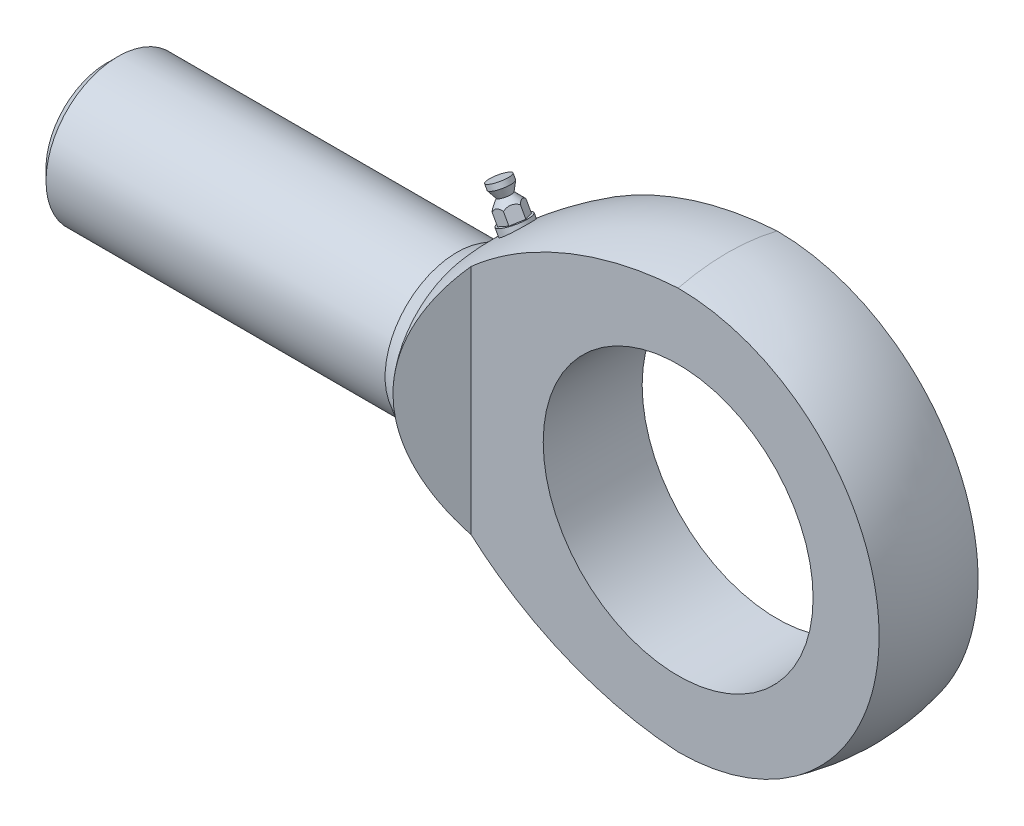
ISO-10303-21;
HEADER;
FILE_DESCRIPTION(('STEP AP214'),'2;1');
FILE_NAME('part.step','',(''),(''),'','','');
FILE_SCHEMA(('AUTOMOTIVE_DESIGN { 1 0 10303 214 1 1 1 1 }'));
ENDSEC;
DATA;
#1=APPLICATION_CONTEXT('core data for automotive mechanical design processes');
#2=APPLICATION_PROTOCOL_DEFINITION('international standard','automotive_design',2000,#1);
#3=PRODUCT_CONTEXT('',#1,'mechanical');
#4=PRODUCT('Part','Part','',(#3));
#5=PRODUCT_RELATED_PRODUCT_CATEGORY('part','',(#4));
#6=PRODUCT_DEFINITION_FORMATION('','',#4);
#7=PRODUCT_DEFINITION_CONTEXT('part definition',#1,'design');
#8=PRODUCT_DEFINITION('design','',#6,#7);
#9=PRODUCT_DEFINITION_SHAPE('','',#8);
#10=(LENGTH_UNIT() NAMED_UNIT(*) SI_UNIT(.MILLI.,.METRE.));
#11=(NAMED_UNIT(*) PLANE_ANGLE_UNIT() SI_UNIT($,.RADIAN.));
#12=(NAMED_UNIT(*) SI_UNIT($,.STERADIAN.) SOLID_ANGLE_UNIT());
#13=UNCERTAINTY_MEASURE_WITH_UNIT(LENGTH_MEASURE(1.E-05),#10,'distance_accuracy_value','');
#14=(GEOMETRIC_REPRESENTATION_CONTEXT(3) GLOBAL_UNCERTAINTY_ASSIGNED_CONTEXT((#13)) GLOBAL_UNIT_ASSIGNED_CONTEXT((#10,
#11,#12)) REPRESENTATION_CONTEXT('',''));
#15=CARTESIAN_POINT('',(0.,0.,0.));
#16=DIRECTION('',(0.,0.,1.));
#17=DIRECTION('',(1.,0.,0.));
#18=AXIS2_PLACEMENT_3D('',#15,#16,#17);
#19=CARTESIAN_POINT('',(43.5603030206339,17.4393707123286,0.6));
#20=DIRECTION('',(-0.485648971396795,0.874153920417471,0.));
#21=DIRECTION('',(-0.874153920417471,-0.485648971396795,0.));
#22=AXIS2_PLACEMENT_3D('',#19,#20,#21);
#23=PLANE('',#22);
#24=CARTESIAN_POINT('',(43.5603030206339,17.4393707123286,0.));
#25=DIRECTION('',(-0.485648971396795,0.874153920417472,0.));
#26=DIRECTION('',(-0.874153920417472,-0.485648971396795,0.));
#27=AXIS2_PLACEMENT_3D('',#24,#25,#26);
#28=CIRCLE('',#27,1.2);
#29=CARTESIAN_POINT('',(42.511318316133,16.8565919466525,0.));
#30=VERTEX_POINT('',#29);
#31=EDGE_CURVE('E113',#30,#30,#28,.F.);
#32=ORIENTED_EDGE('',*,*,#31,.F.);
#33=EDGE_LOOP('',(#32));
#34=FACE_BOUND('',#33,.T.);
#35=ADVANCED_FACE('F16',(#34),#23,.T.);
#36=CARTESIAN_POINT('',(43.705997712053,17.1771245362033,0.));
#37=DIRECTION('',(-0.485648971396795,0.874153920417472,0.));
#38=DIRECTION('',(-0.874153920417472,-0.485648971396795,0.));
#39=AXIS2_PLACEMENT_3D('',#36,#37,#38);
#40=CYLINDRICAL_SURFACE('',#39,1.2);
#41=ORIENTED_EDGE('',*,*,#31,.T.);
#42=EDGE_LOOP('',(#41));
#43=FACE_BOUND('',#42,.T.);
#44=CARTESIAN_POINT('',(43.8516924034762,16.9148783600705,0.));
#45=DIRECTION('',(-0.485648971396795,0.874153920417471,0.));
#46=DIRECTION('',(-0.874153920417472,-0.485648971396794,0.));
#47=AXIS2_PLACEMENT_3D('',#44,#45,#46);
#48=CIRCLE('',#47,1.19999999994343);
#49=CARTESIAN_POINT('',(42.8027076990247,16.3320995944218,0.));
#50=VERTEX_POINT('',#49);
#51=EDGE_CURVE('E347',#50,#50,#48,.F.);
#52=ORIENTED_EDGE('',*,*,#51,.F.);
#53=EDGE_LOOP('',(#52));
#54=FACE_BOUND('',#53,.T.);
#55=ADVANCED_FACE('F561',(#43,#54),#40,.T.);
#56=CARTESIAN_POINT('',(43.8516924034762,16.9148783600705,0.));
#57=DIRECTION('',(-0.485648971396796,0.874153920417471,0.));
#58=DIRECTION('',(-0.874153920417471,-0.485648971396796,0.));
#59=AXIS2_PLACEMENT_3D('',#56,#57,#58);
#60=CONICAL_SURFACE('',#59,1.19999999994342,0.485500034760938);
#61=ORIENTED_EDGE('',*,*,#51,.T.);
#62=EDGE_LOOP('',(#61));
#63=FACE_BOUND('',#62,.T.);
#64=CARTESIAN_POINT('',(44.2644940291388,16.1718475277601,0.));
#65=DIRECTION('',(0.485648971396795,-0.874153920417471,0.));
#66=DIRECTION('',(0.87415392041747,0.485648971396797,0.));
#67=AXIS2_PLACEMENT_3D('',#64,#65,#66);
#68=CIRCLE('',#67,0.751521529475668);
#69=CARTESIAN_POINT('',(44.9214395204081,16.5368231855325,0.));
#70=VERTEX_POINT('',#69);
#71=EDGE_CURVE('E198',#70,#70,#68,.T.);
#72=ORIENTED_EDGE('',*,*,#71,.F.);
#73=EDGE_LOOP('',(#72));
#74=FACE_BOUND('',#73,.T.);
#75=ADVANCED_FACE('F130',(#63,#74),#60,.T.);
#76=CARTESIAN_POINT('',(44.697132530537,15.3931109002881,0.));
#77=DIRECTION('',(0.485648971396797,-0.874153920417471,0.));
#78=DIRECTION('',(0.874153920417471,0.485648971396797,0.));
#79=AXIS2_PLACEMENT_3D('',#76,#77,#78);
#80=CONICAL_SURFACE('',#79,1.44752679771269,0.663225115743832);
#81=CARTESIAN_POINT('',(44.0636859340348,15.047268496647,-1.24999999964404));
#82=CARTESIAN_POINT('',(44.004073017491,15.0725079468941,-1.18097197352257));
#83=CARTESIAN_POINT('',(43.9442975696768,15.0936244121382,-1.10822973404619));
#84=CARTESIAN_POINT('',(43.828943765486,15.1201956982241,-0.955925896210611));
#85=CARTESIAN_POINT('',(43.7734125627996,15.1254941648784,-0.876304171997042));
#86=CARTESIAN_POINT('',(43.6921668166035,15.1148088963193,-0.744303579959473));
#87=CARTESIAN_POINT('',(43.6632786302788,15.1063301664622,-0.693432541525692));
#88=CARTESIAN_POINT('',(43.6108431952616,15.0799686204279,-0.591866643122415));
#89=CARTESIAN_POINT('',(43.5872593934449,15.0621531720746,-0.54117310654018));
#90=CARTESIAN_POINT('',(43.5457003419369,15.0183979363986,-0.441443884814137));
#91=CARTESIAN_POINT('',(43.5276975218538,14.9924993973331,-0.392401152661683));
#92=CARTESIAN_POINT('',(43.4964763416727,14.9343860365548,-0.296246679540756));
#93=CARTESIAN_POINT('',(43.4832884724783,14.9021328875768,-0.24914886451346));
#94=CARTESIAN_POINT('',(43.4634436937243,14.8412258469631,-0.167869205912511));
#95=CARTESIAN_POINT('',(43.4559824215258,14.8134474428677,-0.133205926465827));
#96=CARTESIAN_POINT('',(43.4430550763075,14.756247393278,-0.0655180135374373));
#97=CARTESIAN_POINT('',(43.4375683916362,14.7268466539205,-0.0324797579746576));
#98=CARTESIAN_POINT('',(43.432819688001,14.6967816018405,-6.49388758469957E-08));
#99=B_SPLINE_CURVE_WITH_KNOTS('',3,(#81,#82,#83,#84,#85,#86,#87,#88,#89,#90,#91,#92,#93,#94,#95,
#96,#97,#98),.UNSPECIFIED.,.F.,.F.,(4,2,2,2,2,2,2,2,4),(0.,0.286581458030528,0.575986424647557,
0.752340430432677,0.927439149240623,1.10165855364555,1.27696282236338,1.41199199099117,
1.54556771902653),.UNSPECIFIED.);
#100=CARTESIAN_POINT('',(44.0636859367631,15.0472685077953,-1.25000000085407));
#101=VERTEX_POINT('',#100);
#102=CARTESIAN_POINT('',(43.4328197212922,14.6967818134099,-2.66556516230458E-08));
#103=VERTEX_POINT('',#102);
#104=EDGE_CURVE('E87',#101,#103,#99,.T.);
#105=ORIENTED_EDGE('',*,*,#104,.T.);
#106=CARTESIAN_POINT('',(43.4328197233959,14.6967816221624,7.20144435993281E-08));
#107=CARTESIAN_POINT('',(43.4428827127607,14.7607305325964,0.0690280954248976));
#108=CARTESIAN_POINT('',(43.4565322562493,14.8226393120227,0.141770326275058));
#109=CARTESIAN_POINT('',(43.4949118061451,14.9346193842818,0.294074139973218));
#110=CARTESIAN_POINT('',(43.5197496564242,14.9845680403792,0.373695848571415));
#111=CARTESIAN_POINT('',(43.5717434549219,15.0479059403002,0.505696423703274));
#112=CARTESIAN_POINT('',(43.5942037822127,15.0679546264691,0.556567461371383));
#113=CARTESIAN_POINT('',(43.6442875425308,15.0985491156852,0.658133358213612));
#114=CARTESIAN_POINT('',(43.6718730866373,15.1091615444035,0.708826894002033));
#115=CARTESIAN_POINT('',(43.7309793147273,15.1213323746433,0.808556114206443));
#116=CARTESIAN_POINT('',(43.7624795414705,15.1229359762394,0.857598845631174));
#117=CARTESIAN_POINT('',(43.828315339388,15.1187440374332,0.953753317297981));
#118=CARTESIAN_POINT('',(43.8626673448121,15.1129023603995,1.00085113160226));
#119=CARTESIAN_POINT('',(43.9248651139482,15.0975752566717,1.08213078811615));
#120=CARTESIAN_POINT('',(43.9523924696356,15.0892352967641,1.11679406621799));
#121=CARTESIAN_POINT('',(44.0077883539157,15.0699932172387,1.18448197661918));
#122=CARTESIAN_POINT('',(44.0356500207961,15.0591196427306,1.21752023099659));
#123=CARTESIAN_POINT('',(44.0636858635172,15.0472685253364,1.24999992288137));
#124=B_SPLINE_CURVE_WITH_KNOTS('',3,(#106,#107,#108,#109,#110,#111,#112,#113,#114,#115,#116,
#117,#118,#119,#120,#121,#122,#123),.UNSPECIFIED.,.F.,.F.,(4,2,2,2,2,2,2,2,4),(0.,
0.286581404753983,0.575986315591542,0.752340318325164,0.927439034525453,1.10165843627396,
1.27696270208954,1.41199186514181,1.54556758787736),.UNSPECIFIED.);
#125=CARTESIAN_POINT('',(44.0636858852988,15.0472685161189,1.2499999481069));
#126=VERTEX_POINT('',#125);
#127=EDGE_CURVE('E21',#103,#126,#124,.T.);
#128=ORIENTED_EDGE('',*,*,#127,.T.);
#129=CARTESIAN_POINT('',(44.0636859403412,15.0472684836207,1.24999996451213));
#130=CARTESIAN_POINT('',(44.1085869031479,15.1305721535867,1.24999998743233));
#131=CARTESIAN_POINT('',(44.1589489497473,15.2128771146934,1.24999999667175));
#132=CARTESIAN_POINT('',(44.2741951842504,15.3675616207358,1.25000000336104));
#133=CARTESIAN_POINT('',(44.33921756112,15.4398353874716,1.25000000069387));
#134=CARTESIAN_POINT('',(44.4578311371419,15.5401848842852,1.24999999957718));
#135=CARTESIAN_POINT('',(44.505965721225,15.5744972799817,1.2499999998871));
#136=CARTESIAN_POINT('',(44.6073090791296,15.6335697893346,1.2500000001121));
#137=CARTESIAN_POINT('',(44.6604792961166,15.6583961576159,1.25000000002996));
#138=CARTESIAN_POINT('',(44.7699181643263,15.6985300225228,1.24999999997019));
#139=CARTESIAN_POINT('',(44.8261699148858,15.7138846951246,1.24999999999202));
#140=CARTESIAN_POINT('',(44.9405342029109,15.7366534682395,1.25000000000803));
#141=CARTESIAN_POINT('',(44.9986561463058,15.744017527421,1.25000000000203));
#142=CARTESIAN_POINT('',(45.1018751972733,15.7514803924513,1.24999999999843));
#143=CARTESIAN_POINT('',(45.1468968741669,15.752859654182,1.24999999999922));
#144=CARTESIAN_POINT('',(45.2364543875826,15.752596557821,1.25000000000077));
#145=CARTESIAN_POINT('',(45.28099023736,15.7509865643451,1.25000000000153));
#146=CARTESIAN_POINT('',(45.3254183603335,15.7482424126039,1.25));
#147=B_SPLINE_CURVE_WITH_KNOTS('',3,(#129,#130,#131,#132,#133,#134,#135,#136,#137,#138,#139,
#140,#141,#142,#143,#144,#145,#146),.UNSPECIFIED.,.F.,.F.,(4,2,2,2,2,2,2,2,4),(0.,
0.286581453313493,0.575986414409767,0.752340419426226,0.927439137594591,1.10165854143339,
1.27696280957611,1.41199199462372,1.54556773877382),.UNSPECIFIED.);
#148=CARTESIAN_POINT('',(45.3254183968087,15.7482424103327,1.25));
#149=VERTEX_POINT('',#148);
#150=EDGE_CURVE('E94',#126,#149,#147,.T.);
#151=ORIENTED_EDGE('',*,*,#150,.T.);
#152=CARTESIAN_POINT('',(45.3254184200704,15.7482423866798,1.24999998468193));
#153=CARTESIAN_POINT('',(45.3354814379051,15.81219132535,1.18097196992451));
#154=CARTESIAN_POINT('',(45.3491309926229,15.8741001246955,1.10822973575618));
#155=CARTESIAN_POINT('',(45.3875105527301,15.9860802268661,0.955925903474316));
#156=CARTESIAN_POINT('',(45.4123484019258,16.0360288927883,0.876304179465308));
#157=CARTESIAN_POINT('',(45.4643422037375,16.0993668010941,0.744303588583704));
#158=CARTESIAN_POINT('',(45.4868025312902,16.1194154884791,0.69343255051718));
#159=CARTESIAN_POINT('',(45.5368862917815,16.150009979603,0.591866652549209));
#160=CARTESIAN_POINT('',(45.5644718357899,16.1606224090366,0.541173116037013));
#161=CARTESIAN_POINT('',(45.6235780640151,16.1727932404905,0.441443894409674));
#162=CARTESIAN_POINT('',(45.6550782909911,16.174396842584,0.392401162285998));
#163=CARTESIAN_POINT('',(45.7209140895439,16.1702049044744,0.296246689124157));
#164=CARTESIAN_POINT('',(45.7552660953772,16.1643632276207,0.249148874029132));
#165=CARTESIAN_POINT('',(45.8174638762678,16.1490361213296,0.167869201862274));
#166=CARTESIAN_POINT('',(45.8449912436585,16.1406961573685,0.133205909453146));
#167=CARTESIAN_POINT('',(45.9003871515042,16.1214540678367,0.0655179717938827));
#168=CARTESIAN_POINT('',(45.9282488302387,16.110580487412,0.0324797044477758));
#169=CARTESIAN_POINT('',(45.9562846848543,16.0987293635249,1.02537500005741E-11));
#170=B_SPLINE_CURVE_WITH_KNOTS('',3,(#152,#153,#154,#155,#156,#157,#158,#159,#160,#161,#162,
#163,#164,#165,#166,#167,#168,#169),.UNSPECIFIED.,.F.,.F.,(4,2,2,2,2,2,2,2,4),(0.,
0.286581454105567,0.575986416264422,0.752340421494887,0.927439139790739,1.10165854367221,
1.27696281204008,1.41199203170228,1.54556780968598),.UNSPECIFIED.);
#171=CARTESIAN_POINT('',(45.9562846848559,16.0987293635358,1.90440255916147E-12));
#172=VERTEX_POINT('',#171);
#173=EDGE_CURVE('E112',#149,#172,#170,.T.);
#174=ORIENTED_EDGE('',*,*,#173,.T.);
#175=CARTESIAN_POINT('',(45.9562846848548,16.0987293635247,-9.83171928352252E-12));
#176=CARTESIAN_POINT('',(45.8966717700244,16.1239688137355,-0.0690280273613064));
#177=CARTESIAN_POINT('',(45.8368963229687,16.1450852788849,-0.141770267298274));
#178=CARTESIAN_POINT('',(45.7215425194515,16.1716565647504,-0.294074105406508));
#179=CARTESIAN_POINT('',(45.6660113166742,16.1769550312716,-0.373695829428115));
#180=CARTESIAN_POINT('',(45.5847655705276,16.1662697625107,-0.505696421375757));
#181=CARTESIAN_POINT('',(45.5558773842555,16.1577910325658,-0.556567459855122));
#182=CARTESIAN_POINT('',(45.5034419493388,16.1314294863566,-0.658133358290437));
#183=CARTESIAN_POINT('',(45.4798581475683,16.1136140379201,-0.708826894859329));
#184=CARTESIAN_POINT('',(45.4382990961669,16.0698588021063,-0.808556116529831));
#185=CARTESIAN_POINT('',(45.4202962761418,16.04396026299,-0.857598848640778));
#186=CARTESIAN_POINT('',(45.389075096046,15.9858469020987,-0.95375332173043));
#187=CARTESIAN_POINT('',(45.3758872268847,15.953593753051,-1.0008511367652));
#188=CARTESIAN_POINT('',(45.3560424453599,15.892686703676,-1.08213080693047));
#189=CARTESIAN_POINT('',(45.3485811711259,15.8649082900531,-1.1167940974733));
#190=CARTESIAN_POINT('',(45.335653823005,15.8077082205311,-1.18448203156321));
#191=CARTESIAN_POINT('',(45.3301671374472,15.7783074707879,-1.21752029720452));
#192=CARTESIAN_POINT('',(45.3254184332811,15.7482424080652,-1.24999999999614));
#193=B_SPLINE_CURVE_WITH_KNOTS('',3,(#175,#176,#177,#178,#179,#180,#181,#182,#183,#184,#185,
#186,#187,#188,#189,#190,#191,#192),.UNSPECIFIED.,.F.,.F.,(4,2,2,2,2,2,2,2,4),(0.,
0.286581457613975,0.575986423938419,0.752340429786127,0.927439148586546,1.10165855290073,
1.27696282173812,1.41199203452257,1.54556780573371),.UNSPECIFIED.);
#194=CARTESIAN_POINT('',(45.3254184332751,15.7482424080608,-1.25000000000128));
#195=VERTEX_POINT('',#194);
#196=EDGE_CURVE('E136',#172,#195,#193,.T.);
#197=ORIENTED_EDGE('',*,*,#196,.T.);
#198=CARTESIAN_POINT('',(45.32541843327,15.7482424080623,-1.25));
#199=CARTESIAN_POINT('',(45.2309675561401,15.7541271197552,-1.25));
#200=CARTESIAN_POINT('',(45.1344796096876,15.7548474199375,-1.25));
#201=CARTESIAN_POINT('',(44.9422591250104,15.7387142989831,-1.25));
#202=CARTESIAN_POINT('',(44.846543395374,15.7216876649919,-1.25));
#203=CARTESIAN_POINT('',(44.6986778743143,15.6739908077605,-1.25));
#204=CARTESIAN_POINT('',(44.6441154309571,15.6512483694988,-1.25));
#205=CARTESIAN_POINT('',(44.5404203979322,15.5964088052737,-1.25));
#206=CARTESIAN_POINT('',(44.4912519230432,15.564379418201,-1.25));
#207=CARTESIAN_POINT('',(44.3993602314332,15.4926611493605,-1.25));
#208=CARTESIAN_POINT('',(44.3566058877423,15.4530115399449,-1.25));
#209=CARTESIAN_POINT('',(44.2768562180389,15.36793746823,-1.25));
#210=CARTESIAN_POINT('',(44.2398984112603,15.3224785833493,-1.25));
#211=CARTESIAN_POINT('',(44.1790323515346,15.2387815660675,-1.25));
#212=CARTESIAN_POINT('',(44.154076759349,15.201283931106,-1.25));
#213=CARTESIAN_POINT('',(44.1069877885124,15.125104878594,-1.25));
#214=CARTESIAN_POINT('',(44.0848269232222,15.0864405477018,-1.25));
#215=CARTESIAN_POINT('',(44.0636859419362,15.0472685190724,-1.25));
#216=B_SPLINE_CURVE_WITH_KNOTS('',3,(#198,#199,#200,#201,#202,#203,#204,#205,#206,#207,#208,
#209,#210,#211,#212,#213,#214,#215),.UNSPECIFIED.,.F.,.F.,(4,2,2,2,2,2,2,2,4),(0.,
0.286581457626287,0.575986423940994,0.752340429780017,0.92743914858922,1.10165855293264,
1.27696282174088,1.41199202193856,1.5455677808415),.UNSPECIFIED.);
#217=EDGE_CURVE('E352',#195,#101,#216,.T.);
#218=ORIENTED_EDGE('',*,*,#217,.T.);
#219=EDGE_LOOP('',(#105,#128,#151,#174,#197,#218));
#220=FACE_BOUND('',#219,.T.);
#221=ORIENTED_EDGE('',*,*,#71,.T.);
#222=EDGE_LOOP('',(#221));
#223=FACE_BOUND('',#222,.T.);
#224=ADVANCED_FACE('F91',(#220,#223),#80,.T.);
#225=CARTESIAN_POINT('',(-7.105427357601E-12,0.,0.));
#226=DIRECTION('',(1.,0.,0.));
#227=DIRECTION('',(0.,0.,-1.));
#228=AXIS2_PLACEMENT_3D('',#225,#226,#227);
#229=CONICAL_SURFACE('',#228,6.77132999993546,1.448623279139);
#230=CARTESIAN_POINT('',(-0.831414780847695,0.,0.));
#231=VERTEX_POINT('',#230);
#232=VERTEX_LOOP('',#231);
#233=FACE_BOUND('',#232,.T.);
#234=CARTESIAN_POINT('',(-3.85282084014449E-12,0.,0.));
#235=DIRECTION('',(1.,0.,0.));
#236=DIRECTION('',(0.,0.,-1.));
#237=AXIS2_PLACEMENT_3D('',#234,#235,#236);
#238=CIRCLE('',#237,6.77132999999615);
#239=CARTESIAN_POINT('',(-3.85260399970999E-12,0.,-6.77132999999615));
#240=VERTEX_POINT('',#239);
#241=EDGE_CURVE('E298',#240,#240,#238,.T.);
#242=ORIENTED_EDGE('',*,*,#241,.F.);
#243=EDGE_LOOP('',(#242));
#244=FACE_BOUND('',#243,.T.);
#245=ADVANCED_FACE('F129',(#233,#244),#229,.T.);
#246=CARTESIAN_POINT('',(42.9294367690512,17.0888837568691,-1.25));
#247=DIRECTION('',(0.,0.,1.));
#248=DIRECTION('',(1.,0.,0.));
#249=AXIS2_PLACEMENT_3D('',#246,#247,#248);
#250=PLANE('',#249);
#251=DIRECTION('',(-0.874153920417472,-0.485648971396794,0.));
#252=VECTOR('',#251,1.);
#253=CARTESIAN_POINT('',(45.3086393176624,14.2924165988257,-1.25));
#254=LINE('',#253,#252);
#255=CARTESIAN_POINT('',(44.6777730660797,13.9419296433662,-1.25000000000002));
#256=VERTEX_POINT('',#255);
#257=CARTESIAN_POINT('',(45.9395055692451,14.6429035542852,-1.25000000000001));
#258=VERTEX_POINT('',#257);
#259=EDGE_CURVE('E321',#256,#258,#254,.F.);
#260=ORIENTED_EDGE('',*,*,#259,.F.);
#261=DIRECTION('',(-0.485648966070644,0.874153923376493,-1.05532450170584E-08));
#262=VECTOR('',#261,1.);
#263=CARTESIAN_POINT('',(44.6777730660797,13.9419296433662,-1.25000000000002));
#264=LINE('',#263,#262);
#265=EDGE_CURVE('E295',#256,#101,#264,.T.);
#266=ORIENTED_EDGE('',*,*,#265,.T.);
#267=ORIENTED_EDGE('',*,*,#217,.F.);
#268=DIRECTION('',(0.485648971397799,-0.874153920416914,1.9995455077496E-12));
#269=VECTOR('',#268,1.);
#270=CARTESIAN_POINT('',(45.3254184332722,15.7482424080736,-1.25000000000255));
#271=LINE('',#270,#269);
#272=EDGE_CURVE('E312',#195,#258,#271,.T.);
#273=ORIENTED_EDGE('',*,*,#272,.T.);
#274=EDGE_LOOP('',(#260,#266,#267,#273));
#275=FACE_BOUND('',#274,.T.);
#276=ADVANCED_FACE('F359',(#275),#250,.F.);
#277=CARTESIAN_POINT('',(44.1911692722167,17.7898576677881,-1.25));
#278=DIRECTION('',(-0.757039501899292,-0.420584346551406,0.499999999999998));
#279=DIRECTION('',(0.551113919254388,0.,0.834430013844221));
#280=AXIS2_PLACEMENT_3D('',#277,#278,#279);
#281=PLANE('',#280);
#282=DIRECTION('',(0.43707696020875,0.242824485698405,0.866025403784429));
#283=VECTOR('',#282,1.);
#284=CARTESIAN_POINT('',(45.9395055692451,14.6429035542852,-1.25000000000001));
#285=LINE('',#284,#283);
#286=CARTESIAN_POINT('',(46.5703718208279,14.9933905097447,0.));
#287=VERTEX_POINT('',#286);
#288=EDGE_CURVE('E328',#258,#287,#285,.T.);
#289=ORIENTED_EDGE('',*,*,#288,.F.);
#290=ORIENTED_EDGE('',*,*,#272,.F.);
#291=ORIENTED_EDGE('',*,*,#196,.F.);
#292=DIRECTION('',(0.485648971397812,-0.874153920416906,-2.01909509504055E-12));
#293=VECTOR('',#292,1.);
#294=CARTESIAN_POINT('',(45.9562846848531,16.0987293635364,2.53920148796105E-12));
#295=LINE('',#294,#293);
#296=EDGE_CURVE('E307',#172,#287,#295,.T.);
#297=ORIENTED_EDGE('',*,*,#296,.T.);
#298=EDGE_LOOP('',(#289,#290,#291,#297));
#299=FACE_BOUND('',#298,.T.);
#300=ADVANCED_FACE('F362',(#299),#281,.F.);
#301=CARTESIAN_POINT('',(44.8220355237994,18.1403446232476,0.));
#302=DIRECTION('',(-0.757039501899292,-0.420584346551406,-0.499999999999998));
#303=DIRECTION('',(-0.551113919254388,0.,0.834430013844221));
#304=AXIS2_PLACEMENT_3D('',#301,#302,#303);
#305=PLANE('',#304);
#306=DIRECTION('',(-0.437076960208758,-0.24282448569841,0.866025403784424));
#307=VECTOR('',#306,1.);
#308=CARTESIAN_POINT('',(46.5703718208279,14.9933905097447,0.));
#309=LINE('',#308,#307);
#310=CARTESIAN_POINT('',(45.9395055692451,14.6429035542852,1.25));
#311=VERTEX_POINT('',#310);
#312=EDGE_CURVE('E337',#287,#311,#309,.T.);
#313=ORIENTED_EDGE('',*,*,#312,.F.);
#314=ORIENTED_EDGE('',*,*,#296,.F.);
#315=ORIENTED_EDGE('',*,*,#173,.F.);
#316=DIRECTION('',(0.485648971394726,-0.874153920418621,0.));
#317=VECTOR('',#316,1.);
#318=CARTESIAN_POINT('',(45.3254184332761,15.7482424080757,1.25));
#319=LINE('',#318,#317);
#320=EDGE_CURVE('E107',#149,#311,#319,.T.);
#321=ORIENTED_EDGE('',*,*,#320,.T.);
#322=EDGE_LOOP('',(#313,#314,#315,#321));
#323=FACE_BOUND('',#322,.T.);
#324=ADVANCED_FACE('F167',(#323),#305,.F.);
#325=CARTESIAN_POINT('',(44.1911692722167,17.7898576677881,1.25));
#326=DIRECTION('',(0.,0.,-1.));
#327=DIRECTION('',(-1.,0.,0.));
#328=AXIS2_PLACEMENT_3D('',#325,#326,#327);
#329=PLANE('',#328);
#330=DIRECTION('',(-0.874153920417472,-0.485648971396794,0.));
#331=VECTOR('',#330,1.);
#332=CARTESIAN_POINT('',(45.3086393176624,14.2924165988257,1.25));
#333=LINE('',#332,#331);
#334=CARTESIAN_POINT('',(44.6777730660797,13.9419296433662,1.25000000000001));
#335=VERTEX_POINT('',#334);
#336=EDGE_CURVE('E332',#311,#335,#333,.T.);
#337=ORIENTED_EDGE('',*,*,#336,.F.);
#338=ORIENTED_EDGE('',*,*,#320,.F.);
#339=ORIENTED_EDGE('',*,*,#150,.F.);
#340=DIRECTION('',(0.485648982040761,-0.87415391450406,2.10899841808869E-08));
#341=VECTOR('',#340,1.);
#342=CARTESIAN_POINT('',(44.0636859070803,15.0472685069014,1.24999997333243));
#343=LINE('',#342,#341);
#344=EDGE_CURVE('E100',#126,#335,#343,.T.);
#345=ORIENTED_EDGE('',*,*,#344,.T.);
#346=EDGE_LOOP('',(#337,#338,#339,#345));
#347=FACE_BOUND('',#346,.T.);
#348=ADVANCED_FACE('F109',(#347),#329,.F.);
#349=CARTESIAN_POINT('',(42.9294367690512,17.0888837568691,1.25));
#350=DIRECTION('',(0.757039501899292,0.420584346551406,-0.499999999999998));
#351=DIRECTION('',(-0.551113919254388,0.,-0.834430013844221));
#352=AXIS2_PLACEMENT_3D('',#349,#350,#351);
#353=PLANE('',#352);
#354=DIRECTION('',(-0.437076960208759,-0.24282448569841,-0.866025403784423));
#355=VECTOR('',#354,1.);
#356=CARTESIAN_POINT('',(44.6777730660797,13.9419296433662,1.25000000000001));
#357=LINE('',#356,#355);
#358=CARTESIAN_POINT('',(44.0469068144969,13.5914426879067,0.));
#359=VERTEX_POINT('',#358);
#360=EDGE_CURVE('E104',#335,#359,#357,.T.);
#361=ORIENTED_EDGE('',*,*,#360,.F.);
#362=ORIENTED_EDGE('',*,*,#344,.F.);
#363=ORIENTED_EDGE('',*,*,#127,.F.);
#364=DIRECTION('',(0.485648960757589,-0.874153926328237,2.10805560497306E-08));
#365=VECTOR('',#364,1.);
#366=CARTESIAN_POINT('',(43.4328196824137,14.6967815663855,-2.66556615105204E-08));
#367=LINE('',#366,#365);
#368=EDGE_CURVE('E151',#103,#359,#367,.T.);
#369=ORIENTED_EDGE('',*,*,#368,.T.);
#370=EDGE_LOOP('',(#361,#362,#363,#369));
#371=FACE_BOUND('',#370,.T.);
#372=ADVANCED_FACE('F101',(#371),#353,.F.);
#373=CARTESIAN_POINT('',(42.2985705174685,16.7383968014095,0.));
#374=DIRECTION('',(0.757039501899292,0.420584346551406,0.499999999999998));
#375=DIRECTION('',(0.551113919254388,0.,-0.834430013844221));
#376=AXIS2_PLACEMENT_3D('',#373,#374,#375);
#377=PLANE('',#376);
#378=DIRECTION('',(0.43707696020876,0.242824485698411,-0.866025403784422));
#379=VECTOR('',#378,1.);
#380=CARTESIAN_POINT('',(44.0469068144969,13.5914426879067,0.));
#381=LINE('',#380,#379);
#382=EDGE_CURVE('E294',#359,#256,#381,.T.);
#383=ORIENTED_EDGE('',*,*,#382,.F.);
#384=ORIENTED_EDGE('',*,*,#368,.F.);
#385=ORIENTED_EDGE('',*,*,#104,.F.);
#386=ORIENTED_EDGE('',*,*,#265,.F.);
#387=EDGE_LOOP('',(#383,#384,#385,#386));
#388=FACE_BOUND('',#387,.T.);
#389=ADVANCED_FACE('F154',(#388),#377,.F.);
#390=CARTESIAN_POINT('',(1.22867,0.,0.));
#391=DIRECTION('',(1.,0.,0.));
#392=DIRECTION('',(0.,0.,-1.));
#393=AXIS2_PLACEMENT_3D('',#390,#391,#392);
#394=CONICAL_SURFACE('',#393,8.,0.785398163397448);
#395=CARTESIAN_POINT('',(1.22867,0.,0.));
#396=DIRECTION('',(-1.,0.,0.));
#397=DIRECTION('',(0.,0.,1.));
#398=AXIS2_PLACEMENT_3D('',#395,#396,#397);
#399=CIRCLE('',#398,8.);
#400=CARTESIAN_POINT('',(1.22867,0.,8.));
#401=VERTEX_POINT('',#400);
#402=EDGE_CURVE('E291',#401,#401,#399,.F.);
#403=ORIENTED_EDGE('',*,*,#402,.F.);
#404=EDGE_LOOP('',(#403));
#405=FACE_BOUND('',#404,.T.);
#406=ORIENTED_EDGE('',*,*,#241,.T.);
#407=EDGE_LOOP('',(#406));
#408=FACE_BOUND('',#407,.T.);
#409=ADVANCED_FACE('F158',(#405,#408),#394,.T.);
#410=CARTESIAN_POINT('',(45.3086393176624,14.2924165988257,0.));
#411=DIRECTION('',(-0.485648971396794,0.874153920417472,0.));
#412=DIRECTION('',(-0.874153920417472,-0.485648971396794,0.));
#413=AXIS2_PLACEMENT_3D('',#410,#411,#412);
#414=PLANE('',#413);
#415=CARTESIAN_POINT('',(45.3086393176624,14.2924165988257,0.));
#416=DIRECTION('',(-0.485648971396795,0.874153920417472,0.));
#417=DIRECTION('',(-0.874153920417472,-0.485648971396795,0.));
#418=AXIS2_PLACEMENT_3D('',#415,#416,#417);
#419=CIRCLE('',#418,1.65);
#420=CARTESIAN_POINT('',(43.8662853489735,13.491095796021,0.));
#421=VERTEX_POINT('',#420);
#422=EDGE_CURVE('E152',#421,#421,#419,.F.);
#423=ORIENTED_EDGE('',*,*,#422,.F.);
#424=EDGE_LOOP('',(#423));
#425=FACE_BOUND('',#424,.T.);
#426=ORIENTED_EDGE('',*,*,#360,.T.);
#427=ORIENTED_EDGE('',*,*,#382,.T.);
#428=ORIENTED_EDGE('',*,*,#259,.T.);
#429=ORIENTED_EDGE('',*,*,#288,.T.);
#430=ORIENTED_EDGE('',*,*,#312,.T.);
#431=ORIENTED_EDGE('',*,*,#336,.T.);
#432=EDGE_LOOP('',(#426,#427,#428,#429,#430,#431));
#433=FACE_BOUND('',#432,.T.);
#434=ADVANCED_FACE('F380',(#425,#433),#414,.T.);
#435=CARTESIAN_POINT('',(20.0751045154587,0.,0.));
#436=DIRECTION('',(-1.,0.,0.));
#437=DIRECTION('',(0.,0.,1.));
#438=AXIS2_PLACEMENT_3D('',#435,#436,#437);
#439=CYLINDRICAL_SURFACE('',#438,8.);
#440=ORIENTED_EDGE('',*,*,#402,.T.);
#441=EDGE_LOOP('',(#440));
#442=FACE_BOUND('',#441,.T.);
#443=CARTESIAN_POINT('',(38.9215390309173,0.,0.));
#444=DIRECTION('',(1.,0.,0.));
#445=DIRECTION('',(0.,0.,-1.));
#446=AXIS2_PLACEMENT_3D('',#443,#444,#445);
#447=CIRCLE('',#446,7.99999999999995);
#448=CARTESIAN_POINT('',(38.9215390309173,0.,-7.99999999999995));
#449=VERTEX_POINT('',#448);
#450=EDGE_CURVE('E287',#449,#449,#447,.T.);
#451=ORIENTED_EDGE('',*,*,#450,.F.);
#452=EDGE_LOOP('',(#451));
#453=FACE_BOUND('',#452,.T.);
#454=ADVANCED_FACE('F398',(#442,#453),#439,.T.);
#455=CARTESIAN_POINT('',(45.4907576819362,13.9646088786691,0.));
#456=DIRECTION('',(-0.485648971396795,0.874153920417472,0.));
#457=DIRECTION('',(-0.874153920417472,-0.485648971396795,0.));
#458=AXIS2_PLACEMENT_3D('',#455,#456,#457);
#459=CYLINDRICAL_SURFACE('',#458,1.65);
#460=ORIENTED_EDGE('',*,*,#422,.T.);
#461=EDGE_LOOP('',(#460));
#462=FACE_BOUND('',#461,.T.);
#463=CARTESIAN_POINT('',(46.9274426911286,14.7761336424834,0.));
#464=CARTESIAN_POINT('',(46.9274397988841,14.7761307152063,0.090832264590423));
#465=CARTESIAN_POINT('',(46.9217250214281,14.7709105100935,0.18179135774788));
#466=CARTESIAN_POINT('',(46.8990133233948,14.7501952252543,0.361224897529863));
#467=CARTESIAN_POINT('',(46.8819917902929,14.7346777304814,0.449693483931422));
#468=CARTESIAN_POINT('',(46.837203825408,14.6939500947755,0.621395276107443));
#469=CARTESIAN_POINT('',(46.8094532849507,14.6687542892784,0.704636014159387));
#470=CARTESIAN_POINT('',(46.7440408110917,14.6095692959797,0.863708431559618));
#471=CARTESIAN_POINT('',(46.7063830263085,14.5755837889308,0.939543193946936));
#472=CARTESIAN_POINT('',(46.6216559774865,14.4994529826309,1.08282205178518));
#473=CARTESIAN_POINT('',(46.5744702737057,14.4572069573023,1.1501436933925));
#474=CARTESIAN_POINT('',(46.4722873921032,14.3662064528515,1.27352503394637));
#475=CARTESIAN_POINT('',(46.4172886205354,14.3174506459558,1.32958242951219));
#476=CARTESIAN_POINT('',(46.2994697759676,14.2136445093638,1.43029194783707));
#477=CARTESIAN_POINT('',(46.2364896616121,14.1584681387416,1.47462702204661));
#478=CARTESIAN_POINT('',(46.105498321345,14.0445155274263,1.5489045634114));
#479=CARTESIAN_POINT('',(46.0374865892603,13.9857389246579,1.57884558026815));
#480=CARTESIAN_POINT('',(45.8969797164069,13.8652451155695,1.62395432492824));
#481=CARTESIAN_POINT('',(45.8244267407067,13.8034943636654,1.63885281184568));
#482=CARTESIAN_POINT('',(45.6779309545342,13.6798510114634,1.6524986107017));
#483=CARTESIAN_POINT('',(45.6039881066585,13.6179584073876,1.65124548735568));
#484=CARTESIAN_POINT('',(45.4566589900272,13.4957081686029,1.63252331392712));
#485=CARTESIAN_POINT('',(45.3832739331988,13.4353534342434,1.61502566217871));
#486=CARTESIAN_POINT('',(45.239354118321,13.3180243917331,1.56415429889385));
#487=CARTESIAN_POINT('',(45.168819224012,13.2610499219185,1.53078134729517));
#488=CARTESIAN_POINT('',(45.033571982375,13.15273451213,1.44948544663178));
#489=CARTESIAN_POINT('',(44.9688012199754,13.1013355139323,1.40173710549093));
#490=CARTESIAN_POINT('',(44.8462219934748,13.0048262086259,1.29284084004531));
#491=CARTESIAN_POINT('',(44.7884123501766,12.9597148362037,1.23169519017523));
#492=CARTESIAN_POINT('',(44.6824861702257,12.8776278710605,1.09877762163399));
#493=CARTESIAN_POINT('',(44.6342317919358,12.8405357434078,1.02718746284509));
#494=CARTESIAN_POINT('',(44.5478660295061,12.7745177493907,0.87466880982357));
#495=CARTESIAN_POINT('',(44.5097587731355,12.7455952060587,0.793736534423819));
#496=CARTESIAN_POINT('',(44.4453390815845,12.6968981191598,0.625808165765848));
#497=CARTESIAN_POINT('',(44.4189069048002,12.6770306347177,0.538884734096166));
#498=CARTESIAN_POINT('',(44.3781787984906,12.6464845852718,0.36082270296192));
#499=CARTESIAN_POINT('',(44.363856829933,12.6357863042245,0.269693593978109));
#500=CARTESIAN_POINT('',(44.3532120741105,12.627838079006,0.14830434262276));
#501=CARTESIAN_POINT('',(44.3512701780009,12.6263885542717,0.1186988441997));
#502=CARTESIAN_POINT('',(44.348678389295,12.6244543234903,0.0593998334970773));
#503=CARTESIAN_POINT('',(44.3480284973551,12.6239696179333,0.0297063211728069));
#504=CARTESIAN_POINT('',(44.3480329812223,12.6239722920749,-0.0919065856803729));
#505=CARTESIAN_POINT('',(44.3542675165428,12.6286200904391,-0.183935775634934));
#506=CARTESIAN_POINT('',(44.3790328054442,12.6471341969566,-0.365508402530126));
#507=CARTESIAN_POINT('',(44.3975894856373,12.6610199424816,-0.455046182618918));
#508=CARTESIAN_POINT('',(44.4463808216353,12.6976996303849,-0.628888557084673));
#509=CARTESIAN_POINT('',(44.4766045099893,12.7204852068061,-0.713197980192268));
#510=CARTESIAN_POINT('',(44.5477218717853,12.7744305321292,-0.874242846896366));
#511=CARTESIAN_POINT('',(44.5886105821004,12.8055863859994,-0.9509817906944));
#512=CARTESIAN_POINT('',(44.6798757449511,12.8756395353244,-1.09501822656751));
#513=CARTESIAN_POINT('',(44.7302790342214,12.9145587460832,-1.16228804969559));
#514=CARTESIAN_POINT('',(44.8389048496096,12.9991270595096,-1.28530271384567));
#515=CARTESIAN_POINT('',(44.8971282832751,13.0447769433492,-1.34104621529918));
#516=CARTESIAN_POINT('',(45.0201410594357,13.1420702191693,-1.43997248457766));
#517=CARTESIAN_POINT('',(45.0849830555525,13.1937622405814,-1.48304190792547));
#518=CARTESIAN_POINT('',(45.2188666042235,13.3014574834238,-1.55488250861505));
#519=CARTESIAN_POINT('',(45.2879084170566,13.3574609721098,-1.58365279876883));
#520=CARTESIAN_POINT('',(45.4292152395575,13.4731033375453,-1.62652908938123));
#521=CARTESIAN_POINT('',(45.5015120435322,13.5327824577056,-1.64042171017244));
#522=CARTESIAN_POINT('',(45.6463722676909,13.6533954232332,-1.65253931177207));
#523=CARTESIAN_POINT('',(45.7189357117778,13.7143293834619,-1.65076285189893));
#524=CARTESIAN_POINT('',(45.8634255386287,13.8366410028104,-1.63151604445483));
#525=CARTESIAN_POINT('',(45.9353269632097,13.8980120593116,-1.61381587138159));
#526=CARTESIAN_POINT('',(46.0754443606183,14.0184954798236,-1.56290550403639));
#527=CARTESIAN_POINT('',(46.1436600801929,14.0776076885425,-1.52969424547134));
#528=CARTESIAN_POINT('',(46.2749362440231,14.1921074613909,-1.44840514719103));
#529=CARTESIAN_POINT('',(46.3379654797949,14.2474721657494,-1.4002446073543));
#530=CARTESIAN_POINT('',(46.4566809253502,14.3523329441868,-1.29038906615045));
#531=CARTESIAN_POINT('',(46.5123680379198,14.401829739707,-1.22869573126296));
#532=CARTESIAN_POINT('',(46.6142432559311,14.4927896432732,-1.09417112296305));
#533=CARTESIAN_POINT('',(46.6605282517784,14.5343344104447,-1.02146853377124));
#534=CARTESIAN_POINT('',(46.7429941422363,14.6086061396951,-0.866399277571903));
#535=CARTESIAN_POINT('',(46.7791715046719,14.6413300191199,-0.78402924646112));
#536=CARTESIAN_POINT('',(46.8395637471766,14.6960824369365,-0.614020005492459));
#537=CARTESIAN_POINT('',(46.8640320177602,14.7183373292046,-0.526543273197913));
#538=CARTESIAN_POINT('',(46.9013999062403,14.7523644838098,-0.347330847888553));
#539=CARTESIAN_POINT('',(46.9143267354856,14.7641614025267,-0.255605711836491));
#540=CARTESIAN_POINT('',(46.9233484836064,14.7723959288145,-0.136081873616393));
#541=CARTESIAN_POINT('',(46.9248826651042,14.773796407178,-0.108910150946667));
#542=CARTESIAN_POINT('',(46.9269302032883,14.7756657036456,-0.0544960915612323));
#543=CARTESIAN_POINT('',(46.9274435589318,14.7761345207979,-0.0272537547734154));
#544=CARTESIAN_POINT('',(46.9274426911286,14.7761336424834,0.));
#545=B_SPLINE_CURVE_WITH_KNOTS('',3,(#463,#464,#465,#466,#467,#468,#469,#470,#471,#472,#473,
#474,#475,#476,#477,#478,#479,#480,#481,#482,#483,#484,#485,#486,#487,#488,#489,#490,#491,#492,
#493,#494,#495,#496,#497,#498,#499,#500,#501,#502,#503,#504,#505,#506,#507,#508,#509,#510,#511,
#512,#513,#514,#515,#516,#517,#518,#519,#520,#521,#522,#523,#524,#525,#526,#527,#528,#529,#530,
#531,#532,#533,#534,#535,#536,#537,#538,#539,#540,#541,#542,#543,#544),.UNSPECIFIED.,.T.,.F.,(4,
2,2,2,2,2,2,2,2,2,2,2,2,2,2,2,2,2,2,2,2,2,2,2,2,2,2,2,2,2,2,2,2,2,2,2,2,2,2,2,4),(0.,
0.272391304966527,0.545377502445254,0.817960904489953,1.09043034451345,1.36645658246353,
1.64253920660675,1.92546323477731,2.20841576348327,2.49634747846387,2.78428695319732,
3.07273436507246,3.36116797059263,3.64623058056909,3.93124483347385,4.21178764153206,
4.49244439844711,4.77015177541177,5.04726050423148,5.13634285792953,5.22542525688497,
5.50103188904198,5.77722026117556,6.05314963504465,6.32895082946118,6.60554189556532,
6.88216508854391,7.16119177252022,7.44023576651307,7.7232303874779,8.00625102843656,
8.29342319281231,8.58061506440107,8.86942489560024,9.15819918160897,9.44382696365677,
9.72955443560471,10.0087824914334,10.2873504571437,10.369079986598,10.4508095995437),.UNSPECIFIED.);
#546=CARTESIAN_POINT('',(46.9274426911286,14.7761336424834,0.));
#547=VERTEX_POINT('',#546);
#548=EDGE_CURVE('E268',#547,#547,#545,.T.);
#549=ORIENTED_EDGE('',*,*,#548,.F.);
#550=EDGE_LOOP('',(#549));
#551=FACE_BOUND('',#550,.T.);
#552=ADVANCED_FACE('F257',(#462,#551),#459,.T.);
#553=CARTESIAN_POINT('',(92.,23.,5.5));
#554=DIRECTION('',(0.,0.,-1.));
#555=DIRECTION('',(-1.,0.,0.));
#556=AXIS2_PLACEMENT_3D('',#553,#554,#555);
#557=PLANE('',#556);
#558=CARTESIAN_POINT('',(69.0000000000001,-22.3327114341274,5.5));
#559=CARTESIAN_POINT('',(68.5372339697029,-22.3042249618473,5.5));
#560=CARTESIAN_POINT('',(68.075015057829,-22.2675060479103,5.5));
#561=CARTESIAN_POINT('',(67.1521763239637,-22.1776414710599,5.5));
#562=CARTESIAN_POINT('',(66.6915565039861,-22.1244957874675,5.5));
#563=CARTESIAN_POINT('',(65.3132110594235,-21.9405234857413,5.5));
#564=CARTESIAN_POINT('',(64.3986398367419,-21.785139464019,5.5));
#565=CARTESIAN_POINT('',(62.6038257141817,-21.4138968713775,5.5));
#566=CARTESIAN_POINT('',(61.7232767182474,-21.199508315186,5.5));
#567=CARTESIAN_POINT('',(59.9791378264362,-20.7097335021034,5.5));
#568=CARTESIAN_POINT('',(59.1155512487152,-20.4343354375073,5.5));
#569=CARTESIAN_POINT('',(57.1571252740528,-19.7331982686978,5.5));
#570=CARTESIAN_POINT('',(56.0695208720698,-19.2870884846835,5.5));
#571=CARTESIAN_POINT('',(53.9394118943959,-18.2970530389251,5.5));
#572=CARTESIAN_POINT('',(52.8969144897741,-17.7531118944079,5.5));
#573=CARTESIAN_POINT('',(51.3591495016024,-16.8576796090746,5.5));
#574=CARTESIAN_POINT('',(50.8435271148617,-16.5406760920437,5.5));
#575=CARTESIAN_POINT('',(49.8281597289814,-15.8821124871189,5.5));
#576=CARTESIAN_POINT('',(49.3284145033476,-15.5405527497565,5.5));
#577=CARTESIAN_POINT('',(48.3461103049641,-14.8332930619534,5.5));
#578=CARTESIAN_POINT('',(47.8635558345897,-14.4675868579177,5.5));
#579=CARTESIAN_POINT('',(46.9172663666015,-13.7125141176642,5.5));
#580=CARTESIAN_POINT('',(46.4535329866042,-13.3231455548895,5.5));
#581=CARTESIAN_POINT('',(45.9999999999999,-12.9221774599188,5.5));
#582=B_SPLINE_CURVE_WITH_KNOTS('',3,(#558,#559,#560,#561,#562,#563,#564,#565,#566,#567,#568,
#569,#570,#571,#572,#573,#574,#575,#576,#577,#578,#579,#580,#581),.UNSPECIFIED.,.F.,.F.,(4,2,2,
2,2,2,2,2,2,2,2,4),(0.,1.39077187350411,2.78154549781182,5.56201433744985,8.27865979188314,
10.9958314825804,14.517497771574,18.0397218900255,19.8549572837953,21.6701667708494,
23.4858482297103,25.3016854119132),.UNSPECIFIED.);
#583=CARTESIAN_POINT('',(69.0000000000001,-22.3327114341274,5.5));
#584=VERTEX_POINT('',#583);
#585=CARTESIAN_POINT('',(46.,-12.9221774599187,5.5));
#586=VERTEX_POINT('',#585);
#587=EDGE_CURVE('E243',#584,#586,#582,.T.);
#588=ORIENTED_EDGE('',*,*,#587,.F.);
#589=CARTESIAN_POINT('',(69.,0.,5.5));
#590=DIRECTION('',(0.,0.,-1.));
#591=DIRECTION('',(-1.,0.,0.));
#592=AXIS2_PLACEMENT_3D('',#589,#590,#591);
#593=CIRCLE('',#592,22.3327114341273);
#594=CARTESIAN_POINT('',(69.0000000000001,22.3327114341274,5.5));
#595=VERTEX_POINT('',#594);
#596=EDGE_CURVE('E290',#595,#584,#593,.T.);
#597=ORIENTED_EDGE('',*,*,#596,.F.);
#598=CARTESIAN_POINT('',(46.,12.9221774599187,5.5));
#599=CARTESIAN_POINT('',(46.3959489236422,13.2722464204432,5.5));
#600=CARTESIAN_POINT('',(46.799683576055,13.6134705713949,5.5));
#601=CARTESIAN_POINT('',(47.6216571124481,14.2779255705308,5.5));
#602=CARTESIAN_POINT('',(48.0398950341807,14.601157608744,5.5));
#603=CARTESIAN_POINT('',(48.889706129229,15.2292569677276,5.5));
#604=CARTESIAN_POINT('',(49.321274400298,15.5341309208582,5.5));
#605=CARTESIAN_POINT('',(50.1969155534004,16.1253070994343,5.5));
#606=CARTESIAN_POINT('',(50.6409886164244,16.4116090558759,5.5));
#607=CARTESIAN_POINT('',(51.9671633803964,17.2277349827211,5.5));
#608=CARTESIAN_POINT('',(52.8656386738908,17.7312747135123,5.5));
#609=CARTESIAN_POINT('',(54.7001476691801,18.664309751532,5.5));
#610=CARTESIAN_POINT('',(55.6361840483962,19.0937997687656,5.5));
#611=CARTESIAN_POINT('',(57.5604272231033,19.8852077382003,5.5));
#612=CARTESIAN_POINT('',(58.5493271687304,20.2454433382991,5.5));
#613=CARTESIAN_POINT('',(60.5530631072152,20.8844381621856,5.5));
#614=CARTESIAN_POINT('',(61.5678996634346,21.1631956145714,5.5));
#615=CARTESIAN_POINT('',(63.6449927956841,21.6442053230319,5.5));
#616=CARTESIAN_POINT('',(64.7077870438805,21.844155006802,5.5));
#617=CARTESIAN_POINT('',(66.3114160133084,22.0774476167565,5.5));
#618=CARTESIAN_POINT('',(66.847602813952,22.1441108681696,5.5));
#619=CARTESIAN_POINT('',(67.9222754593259,22.2551453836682,5.5));
#620=CARTESIAN_POINT('',(68.4607612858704,22.2995168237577,5.5));
#621=CARTESIAN_POINT('',(69.0000000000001,22.3327114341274,5.5));
#622=B_SPLINE_CURVE_WITH_KNOTS('',3,(#598,#599,#600,#601,#602,#603,#604,#605,#606,#607,#608,
#609,#610,#611,#612,#613,#614,#615,#616,#617,#618,#619,#620,#621),.UNSPECIFIED.,.F.,.F.,(4,2,2,
2,2,2,2,2,2,2,2,4),(0.,1.58536197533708,3.17061896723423,4.75529976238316,6.34000350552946,
9.4261715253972,12.5125599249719,15.6664164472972,18.8203415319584,22.0605827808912,
23.6811281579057,25.3016607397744),.UNSPECIFIED.);
#623=CARTESIAN_POINT('',(46.,12.9221774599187,5.5));
#624=VERTEX_POINT('',#623);
#625=EDGE_CURVE('E262',#624,#595,#622,.T.);
#626=ORIENTED_EDGE('',*,*,#625,.F.);
#627=DIRECTION('',(0.,1.,0.));
#628=VECTOR('',#627,1.);
#629=CARTESIAN_POINT('',(46.,23.,5.5));
#630=LINE('',#629,#628);
#631=EDGE_CURVE('E284',#624,#586,#630,.F.);
#632=ORIENTED_EDGE('',*,*,#631,.T.);
#633=EDGE_LOOP('',(#588,#597,#626,#632));
#634=FACE_BOUND('',#633,.T.);
#635=CARTESIAN_POINT('',(69.,0.,5.5));
#636=DIRECTION('',(0.,0.,-1.));
#637=DIRECTION('',(-1.,0.,0.));
#638=AXIS2_PLACEMENT_3D('',#635,#636,#637);
#639=CIRCLE('',#638,15.);
#640=CARTESIAN_POINT('',(54.,0.,5.5));
#641=VERTEX_POINT('',#640);
#642=EDGE_CURVE('E250',#641,#641,#639,.T.);
#643=ORIENTED_EDGE('',*,*,#642,.T.);
#644=EDGE_LOOP('',(#643));
#645=FACE_BOUND('',#644,.T.);
#646=ADVANCED_FACE('F251',(#634,#645),#557,.F.);
#647=CARTESIAN_POINT('',(41.,0.,0.));
#648=DIRECTION('',(1.,0.,0.));
#649=DIRECTION('',(0.,0.,-1.));
#650=AXIS2_PLACEMENT_3D('',#647,#648,#649);
#651=CONICAL_SURFACE('',#650,9.19999999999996,0.5235987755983);
#652=CARTESIAN_POINT('',(40.9999999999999,0.,0.));
#653=DIRECTION('',(1.,0.,0.));
#654=DIRECTION('',(0.,0.,-1.));
#655=AXIS2_PLACEMENT_3D('',#652,#653,#654);
#656=CIRCLE('',#655,9.20000000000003);
#657=CARTESIAN_POINT('',(40.9999999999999,0.,9.19999999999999));
#658=VERTEX_POINT('',#657);
#659=CARTESIAN_POINT('',(40.9999999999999,0.,-9.2));
#660=VERTEX_POINT('',#659);
#661=EDGE_CURVE('E249',#658,#660,#656,.T.);
#662=ORIENTED_EDGE('',*,*,#661,.F.);
#663=CARTESIAN_POINT('',(40.9999999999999,0.,0.));
#664=DIRECTION('',(1.,0.,0.));
#665=DIRECTION('',(0.,0.,-1.));
#666=AXIS2_PLACEMENT_3D('',#663,#664,#665);
#667=CIRCLE('',#666,9.20000000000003);
#668=EDGE_CURVE('E416',#660,#658,#667,.T.);
#669=ORIENTED_EDGE('',*,*,#668,.F.);
#670=EDGE_LOOP('',(#662,#669));
#671=FACE_BOUND('',#670,.T.);
#672=ORIENTED_EDGE('',*,*,#450,.T.);
#673=EDGE_LOOP('',(#672));
#674=FACE_BOUND('',#673,.T.);
#675=ADVANCED_FACE('F256',(#671,#674),#651,.T.);
#676=CARTESIAN_POINT('',(46.,23.,5.5));
#677=DIRECTION('',(-0.594843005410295,0.,-0.803841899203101));
#678=DIRECTION('',(-0.803841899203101,0.,0.594843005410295));
#679=AXIS2_PLACEMENT_3D('',#676,#677,#678);
#680=PLANE('',#679);
#681=ORIENTED_EDGE('',*,*,#631,.F.);
#682=CARTESIAN_POINT('',(40.9999999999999,0.,9.20000000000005));
#683=CARTESIAN_POINT('',(40.9999913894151,0.200972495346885,9.20000637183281));
#684=CARTESIAN_POINT('',(41.003479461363,0.401940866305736,9.19742519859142));
#685=CARTESIAN_POINT('',(41.0173848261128,0.803493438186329,9.18713522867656));
#686=CARTESIAN_POINT('',(41.0278016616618,1.00407766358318,9.17942677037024));
#687=CARTESIAN_POINT('',(41.0554866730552,1.40431383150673,9.15893986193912));
#688=CARTESIAN_POINT('',(41.0727480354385,1.60396650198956,9.14616645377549));
#689=CARTESIAN_POINT('',(41.1139945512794,2.00218278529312,9.11564403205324));
#690=CARTESIAN_POINT('',(41.1379797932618,2.20074638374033,9.0978949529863));
#691=CARTESIAN_POINT('',(41.2193111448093,2.79080175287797,9.03770975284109));
#692=CARTESIAN_POINT('',(41.2862903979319,3.18030255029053,8.98814510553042));
#693=CARTESIAN_POINT('',(41.4444732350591,3.95162522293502,8.87108980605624));
#694=CARTESIAN_POINT('',(41.535684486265,4.33344462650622,8.8035934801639));
#695=CARTESIAN_POINT('',(41.7716782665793,5.20277330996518,8.62895808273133));
#696=CARTESIAN_POINT('',(41.9243151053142,5.68699903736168,8.5160068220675));
#697=CARTESIAN_POINT('',(42.2632485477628,6.63685821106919,8.2651960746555));
#698=CARTESIAN_POINT('',(42.4495563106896,7.10248543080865,8.12732833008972));
#699=CARTESIAN_POINT('',(42.852679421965,8.01569475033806,7.82901722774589));
#700=CARTESIAN_POINT('',(43.0696386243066,8.4631781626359,7.66846741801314));
#701=CARTESIAN_POINT('',(43.5296533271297,9.33659022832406,7.32805653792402));
#702=CARTESIAN_POINT('',(43.7727024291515,9.76252412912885,7.14820020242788));
#703=CARTESIAN_POINT('',(44.3280836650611,10.6677383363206,6.73721808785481));
#704=CARTESIAN_POINT('',(44.6449877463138,11.1426893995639,6.50270906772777));
#705=CARTESIAN_POINT('',(45.1399115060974,11.8296862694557,6.13646548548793));
#706=CARTESIAN_POINT('',(45.3074415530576,12.0536047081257,6.01249325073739));
#707=CARTESIAN_POINT('',(45.648969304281,12.493700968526,5.75976271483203));
#708=CARTESIAN_POINT('',(45.8229673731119,12.7098783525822,5.6310041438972));
#709=CARTESIAN_POINT('',(46.,12.9221774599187,5.5));
#710=B_SPLINE_CURVE_WITH_KNOTS('',3,(#682,#683,#684,#685,#686,#687,#688,#689,#690,#691,#692,
#693,#694,#695,#696,#697,#698,#699,#700,#701,#702,#703,#704,#705,#706,#707,#708,#709),
.UNSPECIFIED.,.F.,.F.,(4,2,2,2,2,2,2,2,2,2,2,2,2,4),(0.,0.602863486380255,1.20568719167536,
1.80791230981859,2.4101453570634,3.6036697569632,4.79757224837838,6.35561701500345,
7.91417909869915,9.48031512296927,11.0460679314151,12.895701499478,13.8132358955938,
14.7308220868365),.UNSPECIFIED.);
#711=EDGE_CURVE('E221',#658,#624,#710,.T.);
#712=ORIENTED_EDGE('',*,*,#711,.F.);
#713=CARTESIAN_POINT('',(46.,-12.9221774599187,5.50000000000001));
#714=CARTESIAN_POINT('',(45.806528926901,-12.6901637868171,5.64316859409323));
#715=CARTESIAN_POINT('',(45.61665475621,-12.4534853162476,5.78367548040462));
#716=CARTESIAN_POINT('',(45.2446338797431,-11.9708262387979,6.0589709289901));
#717=CARTESIAN_POINT('',(45.0624886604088,-11.7248438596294,6.19375839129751));
#718=CARTESIAN_POINT('',(44.7059892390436,-11.2229265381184,6.45756796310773));
#719=CARTESIAN_POINT('',(44.5316605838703,-10.9669634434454,6.586571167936));
#720=CARTESIAN_POINT('',(44.1920809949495,-10.445932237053,6.8378600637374));
#721=CARTESIAN_POINT('',(44.0268295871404,-10.1808646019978,6.96014610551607));
#722=CARTESIAN_POINT('',(43.541244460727,-9.36456648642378,7.31947909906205));
#723=CARTESIAN_POINT('',(43.2360409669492,-8.79916743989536,7.54532968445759));
#724=CARTESIAN_POINT('',(42.673437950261,-7.63341862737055,7.96165591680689));
#725=CARTESIAN_POINT('',(42.4159726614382,-7.03311846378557,8.1521802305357));
#726=CARTESIAN_POINT('',(42.0408069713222,-6.02475737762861,8.4298028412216));
#727=CARTESIAN_POINT('',(41.9063506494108,-5.62628634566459,8.52930051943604));
#728=CARTESIAN_POINT('',(41.6626257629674,-4.81745214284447,8.7096569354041));
#729=CARTESIAN_POINT('',(41.5533593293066,-4.40708796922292,8.79051409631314));
#730=CARTESIAN_POINT('',(41.3631938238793,-3.5792689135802,8.93123657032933));
#731=CARTESIAN_POINT('',(41.2821082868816,-3.16188057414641,8.99123986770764));
#732=CARTESIAN_POINT('',(41.149511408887,-2.32004710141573,9.08936155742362));
#733=CARTESIAN_POINT('',(41.097982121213,-1.89560641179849,9.12749323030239));
#734=CARTESIAN_POINT('',(41.0414152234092,-1.22541988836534,9.16935273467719));
#735=CARTESIAN_POINT('',(41.025918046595,-0.980979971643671,9.18082064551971));
#736=CARTESIAN_POINT('',(41.0051952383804,-0.491039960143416,9.19615552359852));
#737=CARTESIAN_POINT('',(40.9999859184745,-0.245538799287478,9.20001042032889));
#738=CARTESIAN_POINT('',(40.9999999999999,0.,9.20000000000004));
#739=B_SPLINE_CURVE_WITH_KNOTS('',3,(#713,#714,#715,#716,#717,#718,#719,#720,#721,#722,#723,
#724,#725,#726,#727,#728,#729,#730,#731,#732,#733,#734,#735,#736,#737,#738),.UNSPECIFIED.,.F.,
.F.,(4,2,2,2,2,2,2,2,2,2,2,2,4),(0.,1.00286875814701,2.00592952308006,3.01205974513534,
4.01813737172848,6.05802569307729,8.09508256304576,9.39042107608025,10.685869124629,
11.9725746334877,13.2584980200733,13.9937915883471,14.7302500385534),.UNSPECIFIED.);
#740=EDGE_CURVE('E236',#586,#658,#739,.T.);
#741=ORIENTED_EDGE('',*,*,#740,.F.);
#742=EDGE_LOOP('',(#681,#712,#741));
#743=FACE_BOUND('',#742,.T.);
#744=ADVANCED_FACE('F407',(#743),#680,.F.);
#745=CARTESIAN_POINT('',(69.,0.,46.));
#746=DIRECTION('',(0.,0.,-1.));
#747=DIRECTION('',(-1.,0.,0.));
#748=AXIS2_PLACEMENT_3D('',#745,#746,#747);
#749=CYLINDRICAL_SURFACE('',#748,15.);
#750=ORIENTED_EDGE('',*,*,#642,.F.);
#751=EDGE_LOOP('',(#750));
#752=FACE_BOUND('',#751,.T.);
#753=CARTESIAN_POINT('',(69.,0.,-5.5));
#754=DIRECTION('',(0.,0.,-1.));
#755=DIRECTION('',(-1.,0.,0.));
#756=AXIS2_PLACEMENT_3D('',#753,#754,#755);
#757=CIRCLE('',#756,15.);
#758=CARTESIAN_POINT('',(54.,0.,-5.5));
#759=VERTEX_POINT('',#758);
#760=EDGE_CURVE('E205',#759,#759,#757,.T.);
#761=ORIENTED_EDGE('',*,*,#760,.T.);
#762=EDGE_LOOP('',(#761));
#763=FACE_BOUND('',#762,.T.);
#764=ADVANCED_FACE('F232',(#752,#763),#749,.F.);
#765=CARTESIAN_POINT('',(71.4014464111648,0.,0.));
#766=DIRECTION('',(-1.,0.,0.));
#767=DIRECTION('',(0.,0.,1.));
#768=AXIS2_PLACEMENT_3D('',#765,#766,#767);
#769=DEGENERATE_TOROIDAL_SURFACE('',#768,17.1782970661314,40.2500000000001,.F.);
#770=ORIENTED_EDGE('',*,*,#587,.T.);
#771=ORIENTED_EDGE('',*,*,#740,.T.);
#772=ORIENTED_EDGE('',*,*,#661,.T.);
#773=CARTESIAN_POINT('',(41.,0.,-9.20000000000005));
#774=CARTESIAN_POINT('',(40.9999913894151,-0.200972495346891,-9.20000637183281));
#775=CARTESIAN_POINT('',(41.003479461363,-0.401940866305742,-9.19742519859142));
#776=CARTESIAN_POINT('',(41.0173848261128,-0.803493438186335,-9.18713522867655));
#777=CARTESIAN_POINT('',(41.0278016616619,-1.00407766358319,-9.17942677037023));
#778=CARTESIAN_POINT('',(41.0554866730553,-1.40431383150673,-9.15893986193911));
#779=CARTESIAN_POINT('',(41.0727480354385,-1.60396650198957,-9.14616645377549));
#780=CARTESIAN_POINT('',(41.1139945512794,-2.00218278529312,-9.11564403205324));
#781=CARTESIAN_POINT('',(41.1379797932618,-2.20074638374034,-9.0978949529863));
#782=CARTESIAN_POINT('',(41.2193111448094,-2.79080175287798,-9.03770975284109));
#783=CARTESIAN_POINT('',(41.2862903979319,-3.18030255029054,-8.98814510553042));
#784=CARTESIAN_POINT('',(41.4444732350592,-3.95162522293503,-8.87108980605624));
#785=CARTESIAN_POINT('',(41.535684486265,-4.33344462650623,-8.8035934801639));
#786=CARTESIAN_POINT('',(41.7716782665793,-5.20277330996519,-8.62895808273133));
#787=CARTESIAN_POINT('',(41.9243151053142,-5.68699903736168,-8.51600682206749));
#788=CARTESIAN_POINT('',(42.2632485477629,-6.6368582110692,-8.2651960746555));
#789=CARTESIAN_POINT('',(42.4495563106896,-7.10248543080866,-8.12732833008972));
#790=CARTESIAN_POINT('',(42.852679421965,-8.01569475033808,-7.82901722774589));
#791=CARTESIAN_POINT('',(43.0696386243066,-8.46317816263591,-7.66846741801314));
#792=CARTESIAN_POINT('',(43.5296533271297,-9.33659022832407,-7.32805653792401));
#793=CARTESIAN_POINT('',(43.7727024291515,-9.76252412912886,-7.14820020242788));
#794=CARTESIAN_POINT('',(44.3280836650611,-10.6677383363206,-6.73721808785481));
#795=CARTESIAN_POINT('',(44.6449877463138,-11.1426893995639,-6.50270906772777));
#796=CARTESIAN_POINT('',(45.1399115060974,-11.8296862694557,-6.13646548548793));
#797=CARTESIAN_POINT('',(45.3074415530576,-12.0536047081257,-6.0124932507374));
#798=CARTESIAN_POINT('',(45.648969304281,-12.493700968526,-5.75976271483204));
#799=CARTESIAN_POINT('',(45.8229673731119,-12.7098783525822,-5.63100414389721));
#800=CARTESIAN_POINT('',(46.,-12.9221774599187,-5.50000000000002));
#801=B_SPLINE_CURVE_WITH_KNOTS('',3,(#773,#774,#775,#776,#777,#778,#779,#780,#781,#782,#783,
#784,#785,#786,#787,#788,#789,#790,#791,#792,#793,#794,#795,#796,#797,#798,#799,#800),
.UNSPECIFIED.,.F.,.F.,(4,2,2,2,2,2,2,2,2,2,2,2,2,4),(0.,0.602863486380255,1.20568719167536,
1.8079123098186,2.4101453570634,3.6036697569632,4.79757224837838,6.35561701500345,
7.91417909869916,9.48031512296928,11.0460679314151,12.895701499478,13.8132358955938,
14.7308220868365),.UNSPECIFIED.);
#802=CARTESIAN_POINT('',(46.,-12.9221774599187,-5.50000000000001));
#803=VERTEX_POINT('',#802);
#804=EDGE_CURVE('E211',#660,#803,#801,.T.);
#805=ORIENTED_EDGE('',*,*,#804,.T.);
#806=CARTESIAN_POINT('',(46.,-12.9221774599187,-5.5));
#807=CARTESIAN_POINT('',(46.3959489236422,-13.2722464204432,-5.5));
#808=CARTESIAN_POINT('',(46.799683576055,-13.6134705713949,-5.5));
#809=CARTESIAN_POINT('',(47.6216571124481,-14.2779255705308,-5.5));
#810=CARTESIAN_POINT('',(48.0398950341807,-14.601157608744,-5.5));
#811=CARTESIAN_POINT('',(48.889706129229,-15.2292569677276,-5.5));
#812=CARTESIAN_POINT('',(49.321274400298,-15.5341309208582,-5.5));
#813=CARTESIAN_POINT('',(50.1969155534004,-16.1253070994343,-5.5));
#814=CARTESIAN_POINT('',(50.6409886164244,-16.4116090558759,-5.5));
#815=CARTESIAN_POINT('',(51.9671633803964,-17.2277349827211,-5.5));
#816=CARTESIAN_POINT('',(52.8656386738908,-17.7312747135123,-5.5));
#817=CARTESIAN_POINT('',(54.7001476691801,-18.664309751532,-5.5));
#818=CARTESIAN_POINT('',(55.6361840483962,-19.0937997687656,-5.5));
#819=CARTESIAN_POINT('',(57.5604272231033,-19.8852077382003,-5.5));
#820=CARTESIAN_POINT('',(58.5493271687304,-20.2454433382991,-5.5));
#821=CARTESIAN_POINT('',(60.5530631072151,-20.8844381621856,-5.5));
#822=CARTESIAN_POINT('',(61.5678996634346,-21.1631956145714,-5.5));
#823=CARTESIAN_POINT('',(63.6449927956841,-21.6442053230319,-5.5));
#824=CARTESIAN_POINT('',(64.7077870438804,-21.8441550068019,-5.5));
#825=CARTESIAN_POINT('',(66.3114160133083,-22.0774476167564,-5.5));
#826=CARTESIAN_POINT('',(66.8476028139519,-22.1441108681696,-5.5));
#827=CARTESIAN_POINT('',(67.9222754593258,-22.2551453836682,-5.5));
#828=CARTESIAN_POINT('',(68.4607612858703,-22.2995168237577,-5.5));
#829=CARTESIAN_POINT('',(69.,-22.3327114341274,-5.5));
#830=B_SPLINE_CURVE_WITH_KNOTS('',3,(#806,#807,#808,#809,#810,#811,#812,#813,#814,#815,#816,
#817,#818,#819,#820,#821,#822,#823,#824,#825,#826,#827,#828,#829),.UNSPECIFIED.,.F.,.F.,(4,2,2,
2,2,2,2,2,2,2,2,4),(0.,1.58536197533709,3.17061896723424,4.75529976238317,6.34000350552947,
9.42617152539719,12.5125599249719,15.6664164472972,18.8203415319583,22.0605827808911,
23.6811281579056,25.3016607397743),.UNSPECIFIED.);
#831=CARTESIAN_POINT('',(69.,-22.3327114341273,-5.5));
#832=VERTEX_POINT('',#831);
#833=EDGE_CURVE('E184',#803,#832,#830,.T.);
#834=ORIENTED_EDGE('',*,*,#833,.T.);
#835=CARTESIAN_POINT('',(69.,0.,0.));
#836=DIRECTION('',(1.,0.,0.));
#837=DIRECTION('',(0.,0.,-1.));
#838=AXIS2_PLACEMENT_3D('',#835,#836,#837);
#839=CIRCLE('',#838,23.);
#840=EDGE_CURVE('E272',#584,#832,#839,.T.);
#841=ORIENTED_EDGE('',*,*,#840,.F.);
#842=EDGE_LOOP('',(#770,#771,#772,#805,#834,#841));
#843=FACE_BOUND('',#842,.T.);
#844=ADVANCED_FACE('F227',(#843),#769,.F.);
#845=CARTESIAN_POINT('',(69.,0.,0.));
#846=DIRECTION('',(1.,0.,0.));
#847=DIRECTION('',(0.,1.,0.));
#848=AXIS2_PLACEMENT_3D('',#845,#846,#847);
#849=SPHERICAL_SURFACE('',#848,23.);
#850=CARTESIAN_POINT('',(69.,0.,-5.5));
#851=DIRECTION('',(0.,0.,1.));
#852=DIRECTION('',(1.,0.,0.));
#853=AXIS2_PLACEMENT_3D('',#850,#851,#852);
#854=CIRCLE('',#853,22.3327114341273);
#855=CARTESIAN_POINT('',(69.0000000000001,22.3327114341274,-5.5));
#856=VERTEX_POINT('',#855);
#857=EDGE_CURVE('E197',#832,#856,#854,.T.);
#858=ORIENTED_EDGE('',*,*,#857,.T.);
#859=CARTESIAN_POINT('',(69.0000000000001,0.,0.));
#860=DIRECTION('',(-1.,0.,0.));
#861=DIRECTION('',(0.,0.,1.));
#862=AXIS2_PLACEMENT_3D('',#859,#860,#861);
#863=CIRCLE('',#862,23.0000000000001);
#864=EDGE_CURVE('E267',#595,#856,#863,.T.);
#865=ORIENTED_EDGE('',*,*,#864,.F.);
#866=ORIENTED_EDGE('',*,*,#596,.T.);
#867=ORIENTED_EDGE('',*,*,#840,.T.);
#868=EDGE_LOOP('',(#858,#865,#866,#867));
#869=FACE_BOUND('',#868,.T.);
#870=ADVANCED_FACE('F231',(#869),#849,.T.);
#871=CARTESIAN_POINT('',(71.4014464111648,0.,0.));
#872=DIRECTION('',(-1.,0.,0.));
#873=DIRECTION('',(0.,0.,1.));
#874=AXIS2_PLACEMENT_3D('',#871,#872,#873);
#875=DEGENERATE_TOROIDAL_SURFACE('',#874,17.1782970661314,40.2500000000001,.F.);
#876=ORIENTED_EDGE('',*,*,#668,.T.);
#877=ORIENTED_EDGE('',*,*,#711,.T.);
#878=ORIENTED_EDGE('',*,*,#625,.T.);
#879=ORIENTED_EDGE('',*,*,#864,.T.);
#880=CARTESIAN_POINT('',(69.0000000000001,22.3327114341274,-5.5));
#881=CARTESIAN_POINT('',(68.5372339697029,22.3042249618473,-5.5));
#882=CARTESIAN_POINT('',(68.075015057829,22.2675060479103,-5.5));
#883=CARTESIAN_POINT('',(67.1521763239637,22.1776414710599,-5.5));
#884=CARTESIAN_POINT('',(66.6915565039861,22.1244957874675,-5.5));
#885=CARTESIAN_POINT('',(65.3132110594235,21.9405234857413,-5.5));
#886=CARTESIAN_POINT('',(64.3986398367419,21.785139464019,-5.5));
#887=CARTESIAN_POINT('',(62.6038257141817,21.4138968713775,-5.5));
#888=CARTESIAN_POINT('',(61.7232767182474,21.199508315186,-5.5));
#889=CARTESIAN_POINT('',(59.9791378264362,20.7097335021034,-5.5));
#890=CARTESIAN_POINT('',(59.1155512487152,20.4343354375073,-5.5));
#891=CARTESIAN_POINT('',(57.1571252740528,19.7331982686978,-5.5));
#892=CARTESIAN_POINT('',(56.0695208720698,19.2870884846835,-5.5));
#893=CARTESIAN_POINT('',(53.9394118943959,18.2970530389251,-5.5));
#894=CARTESIAN_POINT('',(52.8969144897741,17.7531118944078,-5.5));
#895=CARTESIAN_POINT('',(51.3591495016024,16.8576796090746,-5.5));
#896=CARTESIAN_POINT('',(50.8435271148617,16.5406760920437,-5.5));
#897=CARTESIAN_POINT('',(49.8281597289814,15.8821124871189,-5.5));
#898=CARTESIAN_POINT('',(49.3284145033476,15.5405527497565,-5.5));
#899=CARTESIAN_POINT('',(48.3461103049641,14.8332930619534,-5.5));
#900=CARTESIAN_POINT('',(47.8635558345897,14.4675868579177,-5.5));
#901=CARTESIAN_POINT('',(46.9172663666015,13.7125141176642,-5.5));
#902=CARTESIAN_POINT('',(46.4535329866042,13.3231455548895,-5.5));
#903=CARTESIAN_POINT('',(45.9999999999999,12.9221774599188,-5.5));
#904=B_SPLINE_CURVE_WITH_KNOTS('',3,(#880,#881,#882,#883,#884,#885,#886,#887,#888,#889,#890,
#891,#892,#893,#894,#895,#896,#897,#898,#899,#900,#901,#902,#903),.UNSPECIFIED.,.F.,.F.,(4,2,2,
2,2,2,2,2,2,2,2,4),(0.,1.39077187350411,2.78154549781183,5.56201433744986,8.27865979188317,
10.9958314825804,14.517497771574,18.0397218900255,19.8549572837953,21.6701667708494,
23.4858482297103,25.3016854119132),.UNSPECIFIED.);
#905=CARTESIAN_POINT('',(46.,12.9221774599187,-5.50000000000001));
#906=VERTEX_POINT('',#905);
#907=EDGE_CURVE('E32',#856,#906,#904,.T.);
#908=ORIENTED_EDGE('',*,*,#907,.T.);
#909=CARTESIAN_POINT('',(46.,12.9221774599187,-5.50000000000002));
#910=CARTESIAN_POINT('',(45.806528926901,12.6901637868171,-5.64316859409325));
#911=CARTESIAN_POINT('',(45.61665475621,12.4534853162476,-5.78367548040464));
#912=CARTESIAN_POINT('',(45.2446338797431,11.9708262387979,-6.05897092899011));
#913=CARTESIAN_POINT('',(45.0624886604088,11.7248438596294,-6.19375839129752));
#914=CARTESIAN_POINT('',(44.7059892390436,11.2229265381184,-6.45756796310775));
#915=CARTESIAN_POINT('',(44.5316605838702,10.9669634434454,-6.58657116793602));
#916=CARTESIAN_POINT('',(44.1920809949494,10.445932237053,-6.83786006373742));
#917=CARTESIAN_POINT('',(44.0268295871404,10.1808646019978,-6.96014610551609));
#918=CARTESIAN_POINT('',(43.541244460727,9.36456648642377,-7.31947909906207));
#919=CARTESIAN_POINT('',(43.2360409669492,8.79916743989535,-7.54532968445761));
#920=CARTESIAN_POINT('',(42.673437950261,7.63341862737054,-7.9616559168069));
#921=CARTESIAN_POINT('',(42.4159726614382,7.03311846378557,-8.15218023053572));
#922=CARTESIAN_POINT('',(42.0408069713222,6.0247573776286,-8.42980284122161));
#923=CARTESIAN_POINT('',(41.9063506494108,5.62628634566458,-8.52930051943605));
#924=CARTESIAN_POINT('',(41.6626257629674,4.81745214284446,-8.70965693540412));
#925=CARTESIAN_POINT('',(41.5533593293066,4.40708796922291,-8.79051409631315));
#926=CARTESIAN_POINT('',(41.3631938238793,3.57926891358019,-8.93123657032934));
#927=CARTESIAN_POINT('',(41.2821082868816,3.16188057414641,-8.99123986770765));
#928=CARTESIAN_POINT('',(41.149511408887,2.32004710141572,-9.08936155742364));
#929=CARTESIAN_POINT('',(41.097982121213,1.89560641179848,-9.1274932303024));
#930=CARTESIAN_POINT('',(41.0414152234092,1.22541988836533,-9.1693527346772));
#931=CARTESIAN_POINT('',(41.025918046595,0.980979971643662,-9.18082064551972));
#932=CARTESIAN_POINT('',(41.0051952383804,0.491039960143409,-9.19615552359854));
#933=CARTESIAN_POINT('',(40.9999859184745,0.245538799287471,-9.20001042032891));
#934=CARTESIAN_POINT('',(40.9999999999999,0.,-9.20000000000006));
#935=B_SPLINE_CURVE_WITH_KNOTS('',3,(#909,#910,#911,#912,#913,#914,#915,#916,#917,#918,#919,
#920,#921,#922,#923,#924,#925,#926,#927,#928,#929,#930,#931,#932,#933,#934),.UNSPECIFIED.,.F.,
.F.,(4,2,2,2,2,2,2,2,2,2,2,2,4),(0.,1.00286875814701,2.00592952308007,3.01205974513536,
4.01813737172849,6.0580256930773,8.09508256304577,9.39042107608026,10.685869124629,
11.9725746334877,13.2584980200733,13.9937915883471,14.7302500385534),.UNSPECIFIED.);
#936=EDGE_CURVE('E40',#906,#660,#935,.T.);
#937=ORIENTED_EDGE('',*,*,#936,.T.);
#938=EDGE_LOOP('',(#876,#877,#878,#879,#908,#937));
#939=FACE_BOUND('',#938,.T.);
#940=ORIENTED_EDGE('',*,*,#548,.T.);
#941=EDGE_LOOP('',(#940));
#942=FACE_BOUND('',#941,.T.);
#943=ADVANCED_FACE('F18',(#939,#942),#875,.F.);
#944=CARTESIAN_POINT('',(41.,23.,-9.20000000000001));
#945=DIRECTION('',(-0.594843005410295,0.,0.803841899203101));
#946=DIRECTION('',(0.803841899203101,0.,0.594843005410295));
#947=AXIS2_PLACEMENT_3D('',#944,#945,#946);
#948=PLANE('',#947);
#949=DIRECTION('',(0.,1.,0.));
#950=VECTOR('',#949,1.);
#951=CARTESIAN_POINT('',(46.,23.,-5.5));
#952=LINE('',#951,#950);
#953=EDGE_CURVE('E11',#906,#803,#952,.F.);
#954=ORIENTED_EDGE('',*,*,#953,.T.);
#955=ORIENTED_EDGE('',*,*,#804,.F.);
#956=ORIENTED_EDGE('',*,*,#936,.F.);
#957=EDGE_LOOP('',(#954,#955,#956));
#958=FACE_BOUND('',#957,.T.);
#959=ADVANCED_FACE('F170',(#958),#948,.F.);
#960=CARTESIAN_POINT('',(46.,23.,-5.5));
#961=DIRECTION('',(0.,0.,1.));
#962=DIRECTION('',(1.,0.,0.));
#963=AXIS2_PLACEMENT_3D('',#960,#961,#962);
#964=PLANE('',#963);
#965=ORIENTED_EDGE('',*,*,#907,.F.);
#966=ORIENTED_EDGE('',*,*,#857,.F.);
#967=ORIENTED_EDGE('',*,*,#833,.F.);
#968=ORIENTED_EDGE('',*,*,#953,.F.);
#969=EDGE_LOOP('',(#965,#966,#967,#968));
#970=FACE_BOUND('',#969,.T.);
#971=ORIENTED_EDGE('',*,*,#760,.F.);
#972=EDGE_LOOP('',(#971));
#973=FACE_BOUND('',#972,.T.);
#974=ADVANCED_FACE('F168',(#970,#973),#964,.F.);
#975=CLOSED_SHELL('',(#35,#55,#75,#224,#245,#276,#300,#324,#348,#372,#389,#409,#434,#454,#552,
#646,#675,#744,#764,#844,#870,#943,#959,#974));
#976=MANIFOLD_SOLID_BREP('B1',#975);
#977=ADVANCED_BREP_SHAPE_REPRESENTATION('',(#18,#976),#14);
#978=SHAPE_DEFINITION_REPRESENTATION(#9,#977);
ENDSEC;
END-ISO-10303-21;
